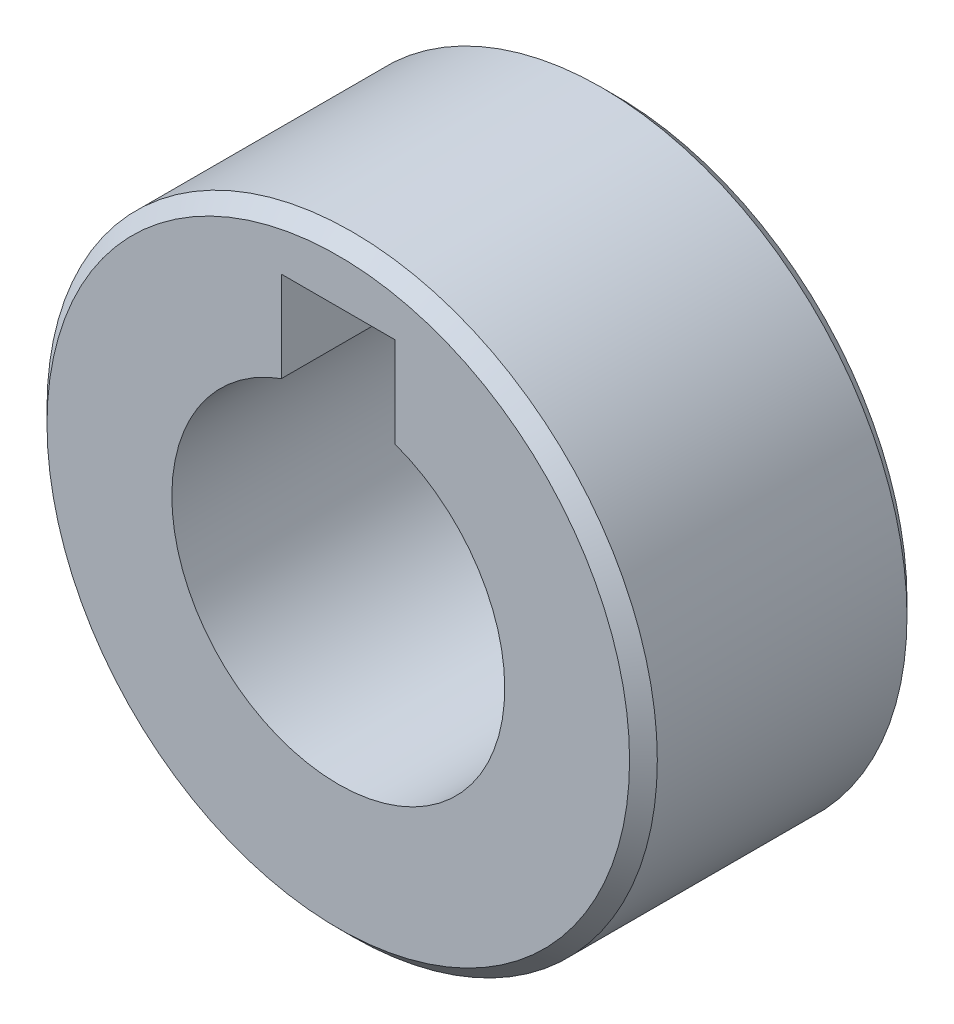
from build123d import *

# Parameters (mm, degrees)
ESQUISSE1_R             = 11
ESQUISSE1_R_2           = 6
EXTRUSION1_DEPTH        = 10
CHANFREIN1_SIZE         = 0.5
ENL_V_MAT_EXTRU_1_DEPTH = 19.493242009


with BuildPart() as part:
    # Esquisse1 → Extrusion1 (new body)
    with BuildSketch(Plane.XY):
        Circle(ESQUISSE1_R)
        Circle(ESQUISSE1_R_2, mode=Mode.SUBTRACT)
    extrude(amount=EXTRUSION1_DEPTH)

    # Chanfrein1
    chanfrein1_edges = [part.edges().sort_by_distance(p)[0] for p in [
        (-11, 0, 0),
        (-11, 0, 10),
    ]]
    chamfer(chanfrein1_edges, length=CHANFREIN1_SIZE)

    # Esquisse2 → Enl_v. mat.-Extru.1 (cut, through all)
    with BuildSketch(Plane.XY.offset(10)):
        with BuildLine():
            Line((-2.05, 5.638927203), (-2.05, 8.9))
            Line((-2.05, 8.9), (2.05, 8.9))
            Line((2.05, 8.9), (2.05, 5.638927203))
            ThreePointArc((2.05, 5.638927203), (0, 6), (-2.05, 5.638927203))
        make_face()
    extrude(amount=-ENL_V_MAT_EXTRU_1_DEPTH, mode=Mode.SUBTRACT)


solid = part.part
